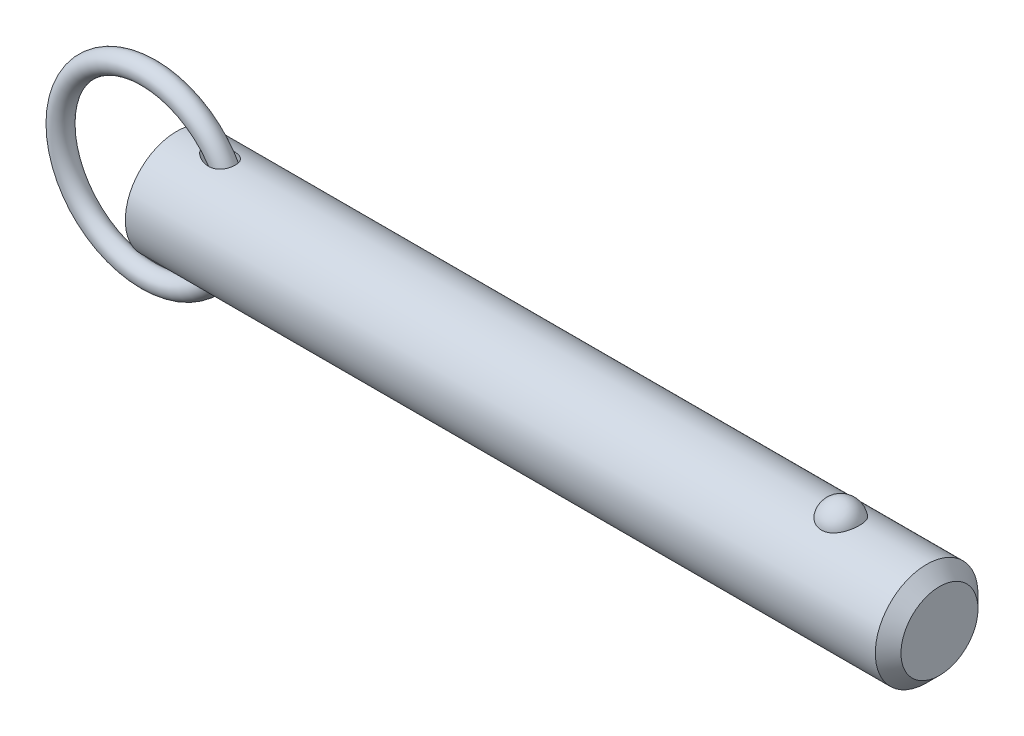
ISO-10303-21;
HEADER;
FILE_DESCRIPTION(('STEP AP214'),'2;1');
FILE_NAME('part.step','',(''),(''),'','','');
FILE_SCHEMA(('AUTOMOTIVE_DESIGN { 1 0 10303 214 1 1 1 1 }'));
ENDSEC;
DATA;
#1=APPLICATION_CONTEXT('core data for automotive mechanical design processes');
#2=APPLICATION_PROTOCOL_DEFINITION('international standard','automotive_design',2000,#1);
#3=PRODUCT_CONTEXT('',#1,'mechanical');
#4=PRODUCT('Part','Part','',(#3));
#5=PRODUCT_RELATED_PRODUCT_CATEGORY('part','',(#4));
#6=PRODUCT_DEFINITION_FORMATION('','',#4);
#7=PRODUCT_DEFINITION_CONTEXT('part definition',#1,'design');
#8=PRODUCT_DEFINITION('design','',#6,#7);
#9=PRODUCT_DEFINITION_SHAPE('','',#8);
#10=(LENGTH_UNIT() NAMED_UNIT(*) SI_UNIT(.MILLI.,.METRE.));
#11=(NAMED_UNIT(*) PLANE_ANGLE_UNIT() SI_UNIT($,.RADIAN.));
#12=(NAMED_UNIT(*) SI_UNIT($,.STERADIAN.) SOLID_ANGLE_UNIT());
#13=UNCERTAINTY_MEASURE_WITH_UNIT(LENGTH_MEASURE(1.E-05),#10,'distance_accuracy_value','');
#14=(GEOMETRIC_REPRESENTATION_CONTEXT(3) GLOBAL_UNCERTAINTY_ASSIGNED_CONTEXT((#13)) GLOBAL_UNIT_ASSIGNED_CONTEXT((#10,
#11,#12)) REPRESENTATION_CONTEXT('',''));
#15=CARTESIAN_POINT('',(0.,0.,0.));
#16=DIRECTION('',(0.,0.,1.));
#17=DIRECTION('',(1.,0.,0.));
#18=AXIS2_PLACEMENT_3D('',#15,#16,#17);
#19=CARTESIAN_POINT('',(-6.08699288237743,0.,0.));
#20=DIRECTION('',(0.,0.,1.));
#21=DIRECTION('',(1.,0.,0.));
#22=AXIS2_PLACEMENT_3D('',#19,#20,#21);
#23=TOROIDAL_SURFACE('',#22,19.05,2.223);
#24=CARTESIAN_POINT('',(15.1860071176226,0.,0.));
#25=VERTEX_POINT('',#24);
#26=VERTEX_LOOP('',#25);
#27=FACE_BOUND('',#26,.T.);
#28=ADVANCED_FACE('P0_F12',(#27),#23,.T.);
#29=CLOSED_SHELL('',(#28));
#30=MANIFOLD_SOLID_BREP('P0_B1',#29);
#31=CARTESIAN_POINT('',(0.,0.,0.));
#32=DIRECTION('',(1.,0.,0.));
#33=DIRECTION('',(0.,0.,-1.));
#34=AXIS2_PLACEMENT_3D('',#31,#32,#33);
#35=CYLINDRICAL_SURFACE('',#34,11.115);
#36=CARTESIAN_POINT('',(6.41405181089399,11.0227946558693,-1.4287136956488));
#37=CARTESIAN_POINT('',(6.49338916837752,11.0115377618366,-1.51556642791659));
#38=CARTESIAN_POINT('',(6.57765461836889,10.9998263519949,-1.59789397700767));
#39=CARTESIAN_POINT('',(6.75386647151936,10.9760304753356,-1.75391400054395));
#40=CARTESIAN_POINT('',(6.84582247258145,10.9639455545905,-1.82759540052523));
#41=CARTESIAN_POINT('',(7.03627827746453,10.9397989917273,-1.96698954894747));
#42=CARTESIAN_POINT('',(7.1348083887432,10.9277377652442,-2.03266078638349));
#43=CARTESIAN_POINT('',(7.33681032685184,10.9041015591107,-2.1558582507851));
#44=CARTESIAN_POINT('',(7.44028007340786,10.8925263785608,-2.21338786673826));
#45=CARTESIAN_POINT('',(7.64386117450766,10.8710104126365,-2.31666528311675));
#46=CARTESIAN_POINT('',(7.74368989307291,10.8610119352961,-2.36295942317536));
#47=CARTESIAN_POINT('',(7.94637195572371,10.8420168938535,-2.44863486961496));
#48=CARTESIAN_POINT('',(8.0492261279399,10.8330206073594,-2.48801426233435));
#49=CARTESIAN_POINT('',(8.36115573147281,10.807980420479,-2.59542730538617));
#50=CARTESIAN_POINT('',(8.57411849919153,10.7938278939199,-2.65299817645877));
#51=CARTESIAN_POINT('',(9.00825016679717,10.7725818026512,-2.73800108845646));
#52=CARTESIAN_POINT('',(9.22947335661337,10.7655491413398,-2.76517330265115));
#53=CARTESIAN_POINT('',(9.6736814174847,10.7605872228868,-2.78445308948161));
#54=CARTESIAN_POINT('',(9.89666486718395,10.7626512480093,-2.77658653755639));
#55=CARTESIAN_POINT('',(10.2950172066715,10.7754452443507,-2.72644436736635));
#56=CARTESIAN_POINT('',(10.4712789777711,10.7844280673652,-2.69109376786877));
#57=CARTESIAN_POINT('',(10.7292776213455,10.8024982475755,-2.61722365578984));
#58=CARTESIAN_POINT('',(10.8142337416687,10.8092901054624,-2.58911576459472));
#59=CARTESIAN_POINT('',(10.9813218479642,10.8242580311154,-2.52581287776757));
#60=CARTESIAN_POINT('',(11.0634550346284,10.8324335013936,-2.49062094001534));
#61=CARTESIAN_POINT('',(11.2247418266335,10.8500287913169,-2.41281958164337));
#62=CARTESIAN_POINT('',(11.3038694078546,10.8594572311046,-2.37015806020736));
#63=CARTESIAN_POINT('',(11.4576781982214,10.8792243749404,-2.27770403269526));
#64=CARTESIAN_POINT('',(11.5323615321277,10.8895626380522,-2.22791497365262));
#65=CARTESIAN_POINT('',(11.6765388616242,10.9108113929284,-2.12140590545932));
#66=CARTESIAN_POINT('',(11.7460329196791,10.9217218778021,-2.064685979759));
#67=CARTESIAN_POINT('',(11.8790597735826,10.9437207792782,-1.94471764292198));
#68=CARTESIAN_POINT('',(11.9425932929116,10.9548091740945,-1.88147002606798));
#69=CARTESIAN_POINT('',(12.109388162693,10.9851999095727,-1.69784918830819));
#70=CARTESIAN_POINT('',(12.205655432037,11.0042655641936,-1.57093023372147));
#71=CARTESIAN_POINT('',(12.374151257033,11.0393391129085,-1.3017676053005));
#72=CARTESIAN_POINT('',(12.4463875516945,11.0553479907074,-1.15952888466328));
#73=CARTESIAN_POINT('',(12.5615818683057,11.0816338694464,-0.871972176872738));
#74=CARTESIAN_POINT('',(12.6058896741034,11.0921698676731,-0.727217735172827));
#75=CARTESIAN_POINT('',(12.6699315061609,11.1075802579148,-0.43208997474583));
#76=CARTESIAN_POINT('',(12.6896681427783,11.1124552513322,-0.281717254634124));
#77=CARTESIAN_POINT('',(12.704022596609,11.1159901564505,0.0188164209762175));
#78=CARTESIAN_POINT('',(12.6988836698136,11.1147102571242,0.16896512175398));
#79=CARTESIAN_POINT('',(12.6641681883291,11.1062126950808,0.466238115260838));
#80=CARTESIAN_POINT('',(12.6345920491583,11.0989951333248,0.613362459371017));
#81=CARTESIAN_POINT('',(12.5517453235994,11.0794095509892,0.900330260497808));
#82=CARTESIAN_POINT('',(12.4984878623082,11.0670443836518,1.04017770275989));
#83=CARTESIAN_POINT('',(12.3696588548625,11.0385082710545,1.308745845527));
#84=CARTESIAN_POINT('',(12.2940887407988,11.0223375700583,1.43746725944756));
#85=CARTESIAN_POINT('',(12.122380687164,10.987872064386,1.68079704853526));
#86=CARTESIAN_POINT('',(12.0261637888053,10.969569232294,1.79534850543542));
#87=CARTESIAN_POINT('',(11.8161707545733,10.932836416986,2.00695695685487));
#88=CARTESIAN_POINT('',(11.7023941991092,10.9144064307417,2.10401353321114));
#89=CARTESIAN_POINT('',(11.4575656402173,10.8788057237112,2.28105326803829));
#90=CARTESIAN_POINT('',(11.3261451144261,10.8616794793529,2.36053412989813));
#91=CARTESIAN_POINT('',(11.0523589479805,10.8308019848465,2.49839044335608));
#92=CARTESIAN_POINT('',(10.9099908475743,10.8170514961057,2.55676113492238));
#93=CARTESIAN_POINT('',(10.6060622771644,10.7929728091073,2.65666105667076));
#94=CARTESIAN_POINT('',(10.4438877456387,10.7830209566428,2.69640163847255));
#95=CARTESIAN_POINT('',(10.1154037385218,10.7687230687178,2.75293129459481));
#96=CARTESIAN_POINT('',(9.94909141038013,10.7643810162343,2.76970406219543));
#97=CARTESIAN_POINT('',(9.54387061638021,10.7604809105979,2.7848723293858));
#98=CARTESIAN_POINT('',(9.30446860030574,10.7637793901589,2.7722775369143));
#99=CARTESIAN_POINT('',(8.94961255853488,10.7757341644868,2.72524141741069));
#100=CARTESIAN_POINT('',(8.83186896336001,10.7808994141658,2.70482239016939));
#101=CARTESIAN_POINT('',(8.59835142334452,10.7932548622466,2.65509992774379));
#102=CARTESIAN_POINT('',(8.48257728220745,10.8004448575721,2.62579738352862));
#103=CARTESIAN_POINT('',(8.25208469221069,10.8166382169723,2.55827624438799));
#104=CARTESIAN_POINT('',(8.13740214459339,10.8256649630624,2.51994155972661));
#105=CARTESIAN_POINT('',(7.91132058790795,10.8451170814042,2.43486475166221));
#106=CARTESIAN_POINT('',(7.79992154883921,10.8555424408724,2.38812270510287));
#107=CARTESIAN_POINT('',(7.58115677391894,10.8774251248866,2.28638483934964));
#108=CARTESIAN_POINT('',(7.47378802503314,10.8888816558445,2.23139534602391));
#109=CARTESIAN_POINT('',(7.26385624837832,10.9124540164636,2.11310265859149));
#110=CARTESIAN_POINT('',(7.16129168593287,10.9245696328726,2.04980214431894));
#111=CARTESIAN_POINT('',(6.91882218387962,10.9543689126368,1.88540538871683));
#112=CARTESIAN_POINT('',(6.7819377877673,10.9721958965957,1.77979827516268));
#113=CARTESIAN_POINT('',(6.52472441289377,11.0070222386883,1.5498969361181));
#114=CARTESIAN_POINT('',(6.40436902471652,11.0240228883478,1.42563320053));
#115=CARTESIAN_POINT('',(6.2183880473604,11.0509658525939,1.19529359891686));
#116=CARTESIAN_POINT('',(6.14691885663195,11.0615430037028,1.09404520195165));
#117=CARTESIAN_POINT('',(6.02043496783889,11.0805004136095,0.881508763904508));
#118=CARTESIAN_POINT('',(5.96539400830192,11.0888841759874,0.7702371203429));
#119=CARTESIAN_POINT('',(5.88475453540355,11.1012553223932,0.560577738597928));
#120=CARTESIAN_POINT('',(5.85559643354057,11.1057686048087,0.463603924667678));
#121=CARTESIAN_POINT('',(5.81381299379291,11.1122523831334,0.266083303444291));
#122=CARTESIAN_POINT('',(5.80117118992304,11.1142254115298,0.165540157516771));
#123=CARTESIAN_POINT('',(5.79363815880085,11.1153999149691,-0.0364747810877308));
#124=CARTESIAN_POINT('',(5.79878799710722,11.1145949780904,-0.137948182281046));
#125=CARTESIAN_POINT('',(5.82639592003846,11.1102987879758,-0.338493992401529));
#126=CARTESIAN_POINT('',(5.8488723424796,11.1068046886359,-0.437563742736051));
#127=CARTESIAN_POINT('',(5.91510741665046,11.0965857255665,-0.649968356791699));
#128=CARTESIAN_POINT('',(5.96220905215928,11.0893566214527,-0.762222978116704));
#129=CARTESIAN_POINT('',(6.07378449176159,11.072471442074,-0.977396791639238));
#130=CARTESIAN_POINT('',(6.13826787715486,11.0628140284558,-1.08031079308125));
#131=CARTESIAN_POINT('',(6.24101077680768,11.0477136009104,-1.2219580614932));
#132=CARTESIAN_POINT('',(6.27403486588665,11.042895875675,-1.26469183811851));
#133=CARTESIAN_POINT('',(6.3423802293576,11.0330152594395,-1.34817011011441));
#134=CARTESIAN_POINT('',(6.37769867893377,11.0279526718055,-1.38891694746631));
#135=CARTESIAN_POINT('',(6.41405181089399,11.0227946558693,-1.4287136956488));
#136=B_SPLINE_CURVE_WITH_KNOTS('',3,(#36,#37,#38,#39,#40,#41,#42,#43,#44,#45,#46,#47,#48,#49,
#50,#51,#52,#53,#54,#55,#56,#57,#58,#59,#60,#61,#62,#63,#64,#65,#66,#67,#68,#69,#70,#71,#72,#73,
#74,#75,#76,#77,#78,#79,#80,#81,#82,#83,#84,#85,#86,#87,#88,#89,#90,#91,#92,#93,#94,#95,#96,#97,
#98,#99,#100,#101,#102,#103,#104,#105,#106,#107,#108,#109,#110,#111,#112,#113,#114,#115,#116,
#117,#118,#119,#120,#121,#122,#123,#124,#125,#126,#127,#128,#129,#130,#131,#132,#133,#134,#135),
.UNSPECIFIED.,.T.,.F.,(4,2,2,2,2,2,2,2,2,2,2,2,2,2,2,2,2,2,2,2,2,2,2,2,2,2,2,2,2,2,2,2,2,2,2,2,
2,2,2,2,2,2,2,2,2,2,2,2,2,4),(0.,0.354433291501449,0.709315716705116,1.0659654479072,
1.42246628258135,1.7536715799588,2.08496839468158,2.74582009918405,3.41227815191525,
4.07824412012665,4.61583787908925,4.88478112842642,5.1536085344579,5.42439170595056,
5.69504436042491,5.96569375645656,6.23631025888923,6.7149072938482,7.1933500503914,
7.6464143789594,8.09943057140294,8.54802575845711,8.99661331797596,9.44495256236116,
9.89326303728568,10.3433195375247,10.7933867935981,11.2550086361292,11.7167345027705,
12.2165866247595,12.7167934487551,13.4318876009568,13.7904664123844,14.1490092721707,
14.5124394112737,14.8758662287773,15.239015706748,15.6020483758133,16.1219860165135,
16.6410830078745,17.0130520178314,17.3844231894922,17.6872330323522,17.9897407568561,
18.2929471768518,18.5964749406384,18.9603532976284,19.3244326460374,19.4870338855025,
19.649438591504),.UNSPECIFIED.);
#137=CARTESIAN_POINT('',(6.41405181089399,11.0227946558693,-1.4287136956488));
#138=VERTEX_POINT('',#137);
#139=EDGE_CURVE('P1_E40',#138,#138,#136,.T.);
#140=ORIENTED_EDGE('',*,*,#139,.T.);
#141=EDGE_LOOP('',(#140));
#142=FACE_BOUND('',#141,.T.);
#143=CARTESIAN_POINT('',(162.32125,0.,0.));
#144=DIRECTION('',(1.,0.,0.));
#145=DIRECTION('',(0.,0.,-1.));
#146=AXIS2_PLACEMENT_3D('',#143,#144,#145);
#147=CIRCLE('',#146,11.115);
#148=CARTESIAN_POINT('',(162.32125,0.,-11.115));
#149=VERTEX_POINT('',#148);
#150=EDGE_CURVE('P1_E25',#149,#149,#147,.T.);
#151=ORIENTED_EDGE('',*,*,#150,.F.);
#152=EDGE_LOOP('',(#151));
#153=FACE_BOUND('',#152,.T.);
#154=CARTESIAN_POINT('',(0.,0.,0.));
#155=DIRECTION('',(1.,0.,0.));
#156=DIRECTION('',(0.,0.,-1.));
#157=AXIS2_PLACEMENT_3D('',#154,#155,#156);
#158=CIRCLE('',#157,11.115);
#159=CARTESIAN_POINT('',(0.,0.,-11.115));
#160=VERTEX_POINT('',#159);
#161=EDGE_CURVE('P1_E9',#160,#160,#158,.T.);
#162=ORIENTED_EDGE('',*,*,#161,.T.);
#163=EDGE_LOOP('',(#162));
#164=FACE_BOUND('',#163,.T.);
#165=CARTESIAN_POINT('',(143.731068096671,10.3028087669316,4.17077409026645));
#166=CARTESIAN_POINT('',(143.514775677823,10.3028003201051,4.17078240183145));
#167=CARTESIAN_POINT('',(143.298548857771,10.3098895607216,4.15340593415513));
#168=CARTESIAN_POINT('',(142.872540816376,10.3373834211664,4.08449540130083));
#169=CARTESIAN_POINT('',(142.662757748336,10.3577841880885,4.0329712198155));
#170=CARTESIAN_POINT('',(142.255782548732,10.4095237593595,3.89746513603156));
#171=CARTESIAN_POINT('',(142.058572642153,10.4408466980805,3.81353029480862));
#172=CARTESIAN_POINT('',(141.681338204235,10.5110236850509,3.61560339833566));
#173=CARTESIAN_POINT('',(141.501317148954,10.5498792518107,3.50160528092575));
#174=CARTESIAN_POINT('',(141.157684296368,10.6322884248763,3.24292464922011));
#175=CARTESIAN_POINT('',(140.994686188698,10.6759443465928,3.09746040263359));
#176=CARTESIAN_POINT('',(140.694591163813,10.7625291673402,2.7817192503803));
#177=CARTESIAN_POINT('',(140.557499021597,10.8054579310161,2.61143778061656));
#178=CARTESIAN_POINT('',(140.306408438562,10.8881935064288,2.24226695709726));
#179=CARTESIAN_POINT('',(140.193710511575,10.9277761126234,2.04244123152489));
#180=CARTESIAN_POINT('',(140.001777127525,10.997484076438,1.62578254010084));
#181=CARTESIAN_POINT('',(139.922544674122,11.0276085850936,1.40894804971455));
#182=CARTESIAN_POINT('',(139.798303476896,11.0756732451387,0.961250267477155));
#183=CARTESIAN_POINT('',(139.753760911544,11.0934470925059,0.730239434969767));
#184=CARTESIAN_POINT('',(139.701569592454,11.1143331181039,0.26343964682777));
#185=CARTESIAN_POINT('',(139.693920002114,11.1174456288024,0.0276507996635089));
#186=CARTESIAN_POINT('',(139.71561056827,11.1087161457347,-0.440729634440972));
#187=CARTESIAN_POINT('',(139.744762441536,11.0969502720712,-0.6733313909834));
#188=CARTESIAN_POINT('',(139.839143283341,11.0597872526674,-1.12996621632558));
#189=CARTESIAN_POINT('',(139.904372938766,11.0343898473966,-1.35399912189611));
#190=CARTESIAN_POINT('',(140.06969844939,10.972515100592,-1.78750286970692));
#191=CARTESIAN_POINT('',(140.16983863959,10.9360236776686,-1.99695478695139));
#192=CARTESIAN_POINT('',(140.402940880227,10.8557595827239,-2.3952066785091));
#193=CARTESIAN_POINT('',(140.535905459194,10.8119863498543,-2.5840050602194));
#194=CARTESIAN_POINT('',(140.832407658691,10.7216733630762,-2.93635726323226));
#195=CARTESIAN_POINT('',(140.996056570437,10.675123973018,-3.09981510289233));
#196=CARTESIAN_POINT('',(141.349860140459,10.5846571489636,-3.39592247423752));
#197=CARTESIAN_POINT('',(141.540012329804,10.5407394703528,-3.52857487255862));
#198=CARTESIAN_POINT('',(141.93750141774,10.4616690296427,-3.75646057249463));
#199=CARTESIAN_POINT('',(142.14436705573,10.4263443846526,-3.85245432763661));
#200=CARTESIAN_POINT('',(142.572954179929,10.3675574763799,-4.00798747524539));
#201=CARTESIAN_POINT('',(142.794670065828,10.344090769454,-4.0675405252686));
#202=CARTESIAN_POINT('',(143.234669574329,10.3128282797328,-4.14614314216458));
#203=CARTESIAN_POINT('',(143.452565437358,10.3043040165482,-4.1670783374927));
#204=CARTESIAN_POINT('',(143.88894951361,10.3016771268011,-4.17357158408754));
#205=CARTESIAN_POINT('',(144.107437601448,10.3075716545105,-4.15913661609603));
#206=CARTESIAN_POINT('',(144.531744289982,10.3326686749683,-4.09636961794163));
#207=CARTESIAN_POINT('',(144.737745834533,10.3514555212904,-4.0490957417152));
#208=CARTESIAN_POINT('',(145.138576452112,10.399818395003,-3.92320197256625));
#209=CARTESIAN_POINT('',(145.3334046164,10.4293952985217,-3.84457953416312));
#210=CARTESIAN_POINT('',(145.711191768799,10.4969600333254,-3.65612410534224));
#211=CARTESIAN_POINT('',(145.893797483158,10.5351178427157,-3.54564545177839));
#212=CARTESIAN_POINT('',(146.238204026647,10.6154999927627,-3.29718036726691));
#213=CARTESIAN_POINT('',(146.400000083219,10.657725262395,-3.15918764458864));
#214=CARTESIAN_POINT('',(146.706959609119,10.744212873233,-2.85163580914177));
#215=CARTESIAN_POINT('',(146.850891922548,10.7884718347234,-2.68084605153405));
#216=CARTESIAN_POINT('',(147.109237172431,10.872374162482,-2.31721864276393));
#217=CARTESIAN_POINT('',(147.223644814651,10.9120167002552,-2.12437704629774));
#218=CARTESIAN_POINT('',(147.423873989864,10.9838919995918,-1.71516999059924));
#219=CARTESIAN_POINT('',(147.50866178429,11.0158465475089,-1.49824866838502));
#220=CARTESIAN_POINT('',(147.64268382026,11.0673523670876,-1.05228572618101));
#221=CARTESIAN_POINT('',(147.691917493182,11.086903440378,-0.823243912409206));
#222=CARTESIAN_POINT('',(147.753891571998,11.1116323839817,-0.359087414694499));
#223=CARTESIAN_POINT('',(147.766566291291,11.1167843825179,-0.123962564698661));
#224=CARTESIAN_POINT('',(147.754973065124,11.1121144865,0.345220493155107));
#225=CARTESIAN_POINT('',(147.730705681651,11.1022928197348,0.579278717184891));
#226=CARTESIAN_POINT('',(147.645907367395,11.0687504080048,1.03866534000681));
#227=CARTESIAN_POINT('',(147.585529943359,11.0450885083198,1.26402641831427));
#228=CARTESIAN_POINT('',(147.429853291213,10.9863185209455,1.70076772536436));
#229=CARTESIAN_POINT('',(147.334551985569,10.9512097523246,1.91214712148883));
#230=CARTESIAN_POINT('',(147.110397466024,10.8729733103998,2.316083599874));
#231=CARTESIAN_POINT('',(146.981380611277,10.8298068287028,2.50854240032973));
#232=CARTESIAN_POINT('',(146.692732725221,10.7401896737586,2.86808766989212));
#233=CARTESIAN_POINT('',(146.533102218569,10.6937390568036,3.03517457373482));
#234=CARTESIAN_POINT('',(146.187534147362,10.6029321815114,3.33857581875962));
#235=CARTESIAN_POINT('',(146.001708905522,10.5585680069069,3.47501541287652));
#236=CARTESIAN_POINT('',(145.607875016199,10.4769321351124,3.71390897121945));
#237=CARTESIAN_POINT('',(145.399863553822,10.439661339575,3.81635861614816));
#238=CARTESIAN_POINT('',(144.954066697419,10.3749407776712,3.98910631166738));
#239=CARTESIAN_POINT('',(144.715234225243,10.3482457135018,4.05700929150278));
#240=CARTESIAN_POINT('',(144.227925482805,10.312188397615,4.14782844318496));
#241=CARTESIAN_POINT('',(143.979453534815,10.3028184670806,4.17076454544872));
#242=CARTESIAN_POINT('',(143.731068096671,10.3028087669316,4.17077409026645));
#243=B_SPLINE_CURVE_WITH_KNOTS('',3,(#165,#166,#167,#168,#169,#170,#171,#172,#173,#174,#175,
#176,#177,#178,#179,#180,#181,#182,#183,#184,#185,#186,#187,#188,#189,#190,#191,#192,#193,#194,
#195,#196,#197,#198,#199,#200,#201,#202,#203,#204,#205,#206,#207,#208,#209,#210,#211,#212,#213,
#214,#215,#216,#217,#218,#219,#220,#221,#222,#223,#224,#225,#226,#227,#228,#229,#230,#231,#232,
#233,#234,#235,#236,#237,#238,#239,#240,#241,#242),.UNSPECIFIED.,.T.,.F.,(4,2,2,2,2,2,2,2,2,2,2,
2,2,2,2,2,2,2,2,2,2,2,2,2,2,2,2,2,2,2,2,2,2,2,2,2,2,2,4),(0.,0.64796614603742,1.29574482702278,
1.9425864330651,2.58955857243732,3.25496465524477,3.92049326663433,4.61566368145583,
5.31089647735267,6.01531821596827,6.71972398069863,7.42054043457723,8.12137023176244,
8.82309331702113,9.5248704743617,10.2292439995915,10.9335519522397,11.6223330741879,
12.3108558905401,12.9647664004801,13.6185478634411,14.252184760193,14.8858731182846,
15.5334360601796,16.1811472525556,16.8611459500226,17.5412664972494,18.2431855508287,
18.9451158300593,19.6483065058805,20.3514864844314,21.0516982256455,21.7519516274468,
22.4556690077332,23.1593743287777,23.8601491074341,24.5610129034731,25.3054529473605,
26.049562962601),.UNSPECIFIED.);
#244=CARTESIAN_POINT('',(143.731068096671,10.3028087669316,4.17077409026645));
#245=VERTEX_POINT('',#244);
#246=EDGE_CURVE('P1_E34',#245,#245,#243,.T.);
#247=ORIENTED_EDGE('',*,*,#246,.T.);
#248=EDGE_LOOP('',(#247));
#249=FACE_BOUND('',#248,.T.);
#250=CARTESIAN_POINT('',(6.41405181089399,-11.0227946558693,-1.4287136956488));
#251=CARTESIAN_POINT('',(6.33124061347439,-11.0345445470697,-1.33806125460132));
#252=CARTESIAN_POINT('',(6.25372866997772,-11.0458090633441,-1.24240732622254));
#253=CARTESIAN_POINT('',(6.11277905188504,-11.0666115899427,-1.04095704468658));
#254=CARTESIAN_POINT('',(6.04933920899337,-11.0761498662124,-0.935162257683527));
#255=CARTESIAN_POINT('',(5.94029181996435,-11.0927063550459,-0.712476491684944));
#256=CARTESIAN_POINT('',(5.89492964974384,-11.0996897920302,-0.595457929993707));
#257=CARTESIAN_POINT('',(5.84498161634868,-11.1074141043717,-0.414997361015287));
#258=CARTESIAN_POINT('',(5.83135004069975,-11.1095300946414,-0.354047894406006));
#259=CARTESIAN_POINT('',(5.81051649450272,-11.1127688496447,-0.231041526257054));
#260=CARTESIAN_POINT('',(5.80331311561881,-11.1138918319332,-0.168984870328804));
#261=CARTESIAN_POINT('',(5.79296529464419,-11.1155042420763,-0.000484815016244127));
#262=CARTESIAN_POINT('',(5.79625267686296,-11.1149904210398,0.106437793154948));
#263=CARTESIAN_POINT('',(5.82213676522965,-11.1109609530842,0.317809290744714));
#264=CARTESIAN_POINT('',(5.84474662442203,-11.1074432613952,0.42225644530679));
#265=CARTESIAN_POINT('',(5.911131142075,-11.097197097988,0.639361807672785));
#266=CARTESIAN_POINT('',(5.95733120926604,-11.090102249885,0.751250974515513));
#267=CARTESIAN_POINT('',(6.06709542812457,-11.0734770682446,0.965912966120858));
#268=CARTESIAN_POINT('',(6.13068735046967,-11.06394284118,1.06867085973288));
#269=CARTESIAN_POINT('',(6.30294237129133,-11.0385920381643,1.30890635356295));
#270=CARTESIAN_POINT('',(6.41896200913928,-11.0218881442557,1.44097376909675));
#271=CARTESIAN_POINT('',(6.6698965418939,-10.9871512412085,1.68553954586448));
#272=CARTESIAN_POINT('',(6.80485520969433,-10.9691152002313,1.79799117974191));
#273=CARTESIAN_POINT('',(7.04881236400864,-10.9382283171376,1.97587596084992));
#274=CARTESIAN_POINT('',(7.15465712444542,-10.9253240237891,2.04570822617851));
#275=CARTESIAN_POINT('',(7.37202504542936,-10.9000987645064,2.17611840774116));
#276=CARTESIAN_POINT('',(7.48355057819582,-10.8877780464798,2.23669241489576));
#277=CARTESIAN_POINT('',(7.71132418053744,-10.8641580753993,2.34873831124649));
#278=CARTESIAN_POINT('',(7.82757727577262,-10.8528599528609,2.40020018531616));
#279=CARTESIAN_POINT('',(8.06386825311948,-10.8317234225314,2.49385169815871));
#280=CARTESIAN_POINT('',(8.18390558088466,-10.8218848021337,2.53604268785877));
#281=CARTESIAN_POINT('',(8.42918336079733,-10.8039208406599,2.61152283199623));
#282=CARTESIAN_POINT('',(8.55447802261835,-10.7958283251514,2.64464414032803));
#283=CARTESIAN_POINT('',(8.80752127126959,-10.781995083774,2.70048793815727));
#284=CARTESIAN_POINT('',(8.93527019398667,-10.7762546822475,2.72320899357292));
#285=CARTESIAN_POINT('',(9.1921017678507,-10.7675291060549,2.75750994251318));
#286=CARTESIAN_POINT('',(9.32118105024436,-10.7645381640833,2.76911315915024));
#287=CARTESIAN_POINT('',(9.57984338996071,-10.761622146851,2.78042035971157));
#288=CARTESIAN_POINT('',(9.70942621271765,-10.7616957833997,2.78012934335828));
#289=CARTESIAN_POINT('',(10.0243125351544,-10.7659059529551,2.76381534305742));
#290=CARTESIAN_POINT('',(10.209307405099,-10.7717977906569,2.74099674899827));
#291=CARTESIAN_POINT('',(10.5731188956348,-10.7905408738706,2.66626238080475));
#292=CARTESIAN_POINT('',(10.7519389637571,-10.8033881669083,2.61436313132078));
#293=CARTESIAN_POINT('',(11.0114289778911,-10.8271584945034,2.51336808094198));
#294=CARTESIAN_POINT('',(11.096831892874,-10.835881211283,2.47562331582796));
#295=CARTESIAN_POINT('',(11.2636000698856,-10.8545688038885,2.39236170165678));
#296=CARTESIAN_POINT('',(11.3449673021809,-10.8645330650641,2.3468486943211));
#297=CARTESIAN_POINT('',(11.5027832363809,-10.8853818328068,2.24815967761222));
#298=CARTESIAN_POINT('',(11.5792327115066,-10.8962661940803,2.19498487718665));
#299=CARTESIAN_POINT('',(11.7263315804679,-10.9185541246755,2.08128855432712));
#300=CARTESIAN_POINT('',(11.7969818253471,-10.9299576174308,2.02076811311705));
#301=CARTESIAN_POINT('',(11.9817953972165,-10.9613645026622,1.84513663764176));
#302=CARTESIAN_POINT('',(12.0893012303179,-10.9814643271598,1.72286660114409));
#303=CARTESIAN_POINT('',(12.2803576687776,-11.0193991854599,1.46066991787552));
#304=CARTESIAN_POINT('',(12.3639173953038,-11.0372350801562,1.3207500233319));
#305=CARTESIAN_POINT('',(12.4996220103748,-11.0672969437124,1.03778067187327));
#306=CARTESIAN_POINT('',(12.5535315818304,-11.0798242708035,0.895607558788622));
#307=CARTESIAN_POINT('',(12.636874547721,-11.0995427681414,0.603918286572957));
#308=CARTESIAN_POINT('',(12.6663115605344,-11.1067347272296,0.454403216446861));
#309=CARTESIAN_POINT('',(12.6997387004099,-11.1149224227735,0.154577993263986));
#310=CARTESIAN_POINT('',(12.7040886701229,-11.1160057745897,0.00431019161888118));
#311=CARTESIAN_POINT('',(12.6882048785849,-11.1120956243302,-0.294841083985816));
#312=CARTESIAN_POINT('',(12.6679715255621,-11.1071022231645,-0.443724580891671));
#313=CARTESIAN_POINT('',(12.6034470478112,-11.0915888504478,-0.735688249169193));
#314=CARTESIAN_POINT('',(12.5591858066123,-11.0810757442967,-0.878775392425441));
#315=CARTESIAN_POINT('',(12.4477416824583,-11.0556687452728,-1.15529525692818));
#316=CARTESIAN_POINT('',(12.3805601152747,-11.0407751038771,-1.28872853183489));
#317=CARTESIAN_POINT('',(12.2248919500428,-11.0081839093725,-1.54257976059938));
#318=CARTESIAN_POINT('',(12.1363549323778,-10.9904797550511,-1.66296592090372));
#319=CARTESIAN_POINT('',(11.9406137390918,-10.9541951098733,-1.88726577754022));
#320=CARTESIAN_POINT('',(11.833409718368,-10.9356146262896,-1.9911796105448));
#321=CARTESIAN_POINT('',(11.601318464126,-10.8991360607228,-2.18213646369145));
#322=CARTESIAN_POINT('',(11.4761325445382,-10.8812577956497,-2.26881927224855));
#323=CARTESIAN_POINT('',(11.2134852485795,-10.8482871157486,-2.42157282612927));
#324=CARTESIAN_POINT('',(11.0760218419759,-10.8331951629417,-2.48764015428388));
#325=CARTESIAN_POINT('',(10.7828968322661,-10.8061050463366,-2.60290068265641));
#326=CARTESIAN_POINT('',(10.6266338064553,-10.7943907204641,-2.65062248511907));
#327=CARTESIAN_POINT('',(10.3086617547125,-10.7762429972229,-2.72345054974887));
#328=CARTESIAN_POINT('',(10.146948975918,-10.7698133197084,-2.74854088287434));
#329=CARTESIAN_POINT('',(9.75541304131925,-10.7608036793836,-2.78368719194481));
#330=CARTESIAN_POINT('',(9.52459435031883,-10.7608467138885,-2.78350276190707));
#331=CARTESIAN_POINT('',(9.0660496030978,-10.7702674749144,-2.74677945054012));
#332=CARTESIAN_POINT('',(8.83832966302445,-10.7796615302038,-2.71017697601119));
#333=CARTESIAN_POINT('',(8.38783466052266,-10.8058248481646,-2.60392490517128));
#334=CARTESIAN_POINT('',(8.16517101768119,-10.8226939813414,-2.53382676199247));
#335=CARTESIAN_POINT('',(7.84087311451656,-10.8516548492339,-2.40555545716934));
#336=CARTESIAN_POINT('',(7.73435551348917,-10.8619221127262,-2.35892455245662));
#337=CARTESIAN_POINT('',(7.52510420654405,-10.883357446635,-2.25797017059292));
#338=CARTESIAN_POINT('',(7.42236986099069,-10.8945253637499,-2.20364800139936));
#339=CARTESIAN_POINT('',(7.23808758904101,-10.915528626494,-2.09688018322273));
#340=CARTESIAN_POINT('',(7.15584631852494,-10.9252787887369,-2.0456107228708));
#341=CARTESIAN_POINT('',(6.99510576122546,-10.944960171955,-1.93754729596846));
#342=CARTESIAN_POINT('',(6.91660574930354,-10.9548913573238,-1.88075440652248));
#343=CARTESIAN_POINT('',(6.76418133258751,-10.974690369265,-1.76154504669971));
#344=CARTESIAN_POINT('',(6.69024940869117,-10.9845582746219,-1.6991382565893));
#345=CARTESIAN_POINT('',(6.54780119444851,-11.0039826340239,-1.56842485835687));
#346=CARTESIAN_POINT('',(6.47928247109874,-11.0135392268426,-1.50012092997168));
#347=CARTESIAN_POINT('',(6.41405181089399,-11.0227946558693,-1.4287136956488));
#348=B_SPLINE_CURVE_WITH_KNOTS('',3,(#250,#251,#252,#253,#254,#255,#256,#257,#258,#259,#260,
#261,#262,#263,#264,#265,#266,#267,#268,#269,#270,#271,#272,#273,#274,#275,#276,#277,#278,#279,
#280,#281,#282,#283,#284,#285,#286,#287,#288,#289,#290,#291,#292,#293,#294,#295,#296,#297,#298,
#299,#300,#301,#302,#303,#304,#305,#306,#307,#308,#309,#310,#311,#312,#313,#314,#315,#316,#317,
#318,#319,#320,#321,#322,#323,#324,#325,#326,#327,#328,#329,#330,#331,#332,#333,#334,#335,#336,
#337,#338,#339,#340,#341,#342,#343,#344,#345,#346,#347),.UNSPECIFIED.,.T.,.F.,(4,2,2,2,2,2,2,2,
2,2,2,2,2,2,2,2,2,2,2,2,2,2,2,2,2,2,2,2,2,2,2,2,2,2,2,2,2,2,2,2,2,2,2,2,2,2,2,2,4),(0.,
0.369835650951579,0.739614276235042,1.11425380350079,1.30141910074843,1.48854338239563,
1.80745879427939,2.12659146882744,2.48838884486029,2.85076733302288,3.3776216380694,
3.9057143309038,4.287639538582,4.66972556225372,5.05222896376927,5.43467659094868,
5.82378546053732,6.21294796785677,6.6012922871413,6.98947336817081,7.54669558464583,
8.10360148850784,8.38458539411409,8.66543074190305,8.94623182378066,9.22699162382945,
9.71628887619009,10.2053995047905,10.6608871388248,11.1163074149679,11.5651786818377,
12.0140424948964,12.4623493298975,12.9106304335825,13.3599804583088,13.8093267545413,
14.2672570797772,14.7252632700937,15.214740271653,15.7045615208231,16.3932594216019,
17.083162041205,17.7825738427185,18.1325177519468,18.4824022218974,18.7744056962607,
19.0663523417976,19.3578048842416,19.6491256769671),.UNSPECIFIED.);
#349=CARTESIAN_POINT('',(6.41405181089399,-11.0227946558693,-1.4287136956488));
#350=VERTEX_POINT('',#349);
#351=EDGE_CURVE('P1_E17',#350,#350,#348,.T.);
#352=ORIENTED_EDGE('',*,*,#351,.T.);
#353=EDGE_LOOP('',(#352));
#354=FACE_BOUND('',#353,.T.);
#355=ADVANCED_FACE('P1_F13',(#142,#153,#164,#249,#354),#35,.T.);
#356=CARTESIAN_POINT('',(0.,0.,0.));
#357=DIRECTION('',(-1.,0.,0.));
#358=DIRECTION('',(0.,0.,1.));
#359=AXIS2_PLACEMENT_3D('',#356,#357,#358);
#360=PLANE('',#359);
#361=ORIENTED_EDGE('',*,*,#161,.F.);
#362=EDGE_LOOP('',(#361));
#363=FACE_BOUND('',#362,.T.);
#364=ADVANCED_FACE('P1_F15',(#363),#360,.T.);
#365=CARTESIAN_POINT('',(165.1,0.,0.));
#366=DIRECTION('',(-1.,0.,0.));
#367=DIRECTION('',(0.,0.,1.));
#368=AXIS2_PLACEMENT_3D('',#365,#366,#367);
#369=CONICAL_SURFACE('',#368,8.33625000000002,0.78539816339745);
#370=ORIENTED_EDGE('',*,*,#150,.T.);
#371=EDGE_LOOP('',(#370));
#372=FACE_BOUND('',#371,.T.);
#373=CARTESIAN_POINT('',(165.1,0.,0.));
#374=DIRECTION('',(1.,0.,0.));
#375=DIRECTION('',(0.,0.,-1.));
#376=AXIS2_PLACEMENT_3D('',#373,#374,#375);
#377=CIRCLE('',#376,8.33625000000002);
#378=CARTESIAN_POINT('',(165.1,0.,-8.33625000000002));
#379=VERTEX_POINT('',#378);
#380=EDGE_CURVE('P1_E30',#379,#379,#377,.T.);
#381=ORIENTED_EDGE('',*,*,#380,.F.);
#382=EDGE_LOOP('',(#381));
#383=FACE_BOUND('',#382,.T.);
#384=ADVANCED_FACE('P1_F55',(#372,#383),#369,.T.);
#385=CARTESIAN_POINT('',(165.1,8.33625000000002,0.));
#386=DIRECTION('',(1.,0.,0.));
#387=DIRECTION('',(0.,0.,-1.));
#388=AXIS2_PLACEMENT_3D('',#385,#386,#387);
#389=PLANE('',#388);
#390=ORIENTED_EDGE('',*,*,#380,.T.);
#391=EDGE_LOOP('',(#390));
#392=FACE_BOUND('',#391,.T.);
#393=ADVANCED_FACE('P1_F51',(#392),#389,.T.);
#394=CARTESIAN_POINT('',(143.731068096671,10.0035,0.));
#395=DIRECTION('',(-1.,0.,0.));
#396=DIRECTION('',(0.,1.,0.));
#397=AXIS2_PLACEMENT_3D('',#394,#395,#396);
#398=SPHERICAL_SURFACE('',#397,4.18150000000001);
#399=ORIENTED_EDGE('',*,*,#246,.F.);
#400=EDGE_LOOP('',(#399));
#401=FACE_BOUND('',#400,.T.);
#402=ADVANCED_FACE('P1_F46',(#401),#398,.T.);
#403=CARTESIAN_POINT('',(-6.08699288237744,0.,0.));
#404=DIRECTION('',(0.,0.,1.));
#405=DIRECTION('',(1.,0.,0.));
#406=AXIS2_PLACEMENT_3D('',#403,#404,#405);
#407=TOROIDAL_SURFACE('',#406,19.05,2.77875);
#408=ORIENTED_EDGE('',*,*,#351,.F.);
#409=EDGE_LOOP('',(#408));
#410=FACE_BOUND('',#409,.T.);
#411=ORIENTED_EDGE('',*,*,#139,.F.);
#412=EDGE_LOOP('',(#411));
#413=FACE_BOUND('',#412,.T.);
#414=ADVANCED_FACE('P1_F50',(#410,#413),#407,.F.);
#415=CLOSED_SHELL('',(#355,#364,#384,#393,#402,#414));
#416=MANIFOLD_SOLID_BREP('P1_B1',#415);
#417=ADVANCED_BREP_SHAPE_REPRESENTATION('',(#18,#30,#416),#14);
#418=SHAPE_DEFINITION_REPRESENTATION(#9,#417);
ENDSEC;
END-ISO-10303-21;
